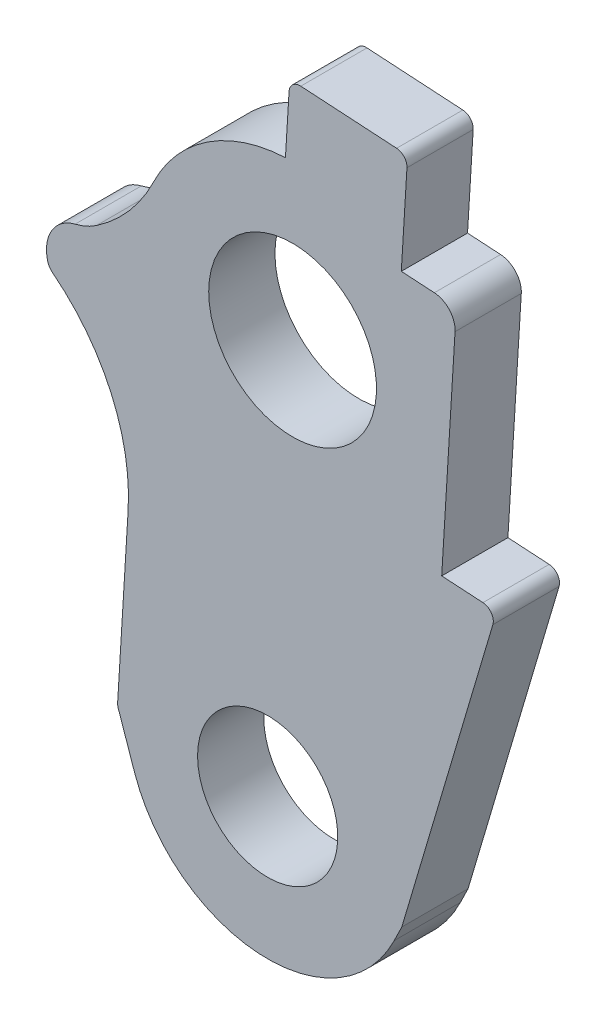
ISO-10303-21;
HEADER;
FILE_DESCRIPTION(('STEP AP214'),'2;1');
FILE_NAME('part.step','',(''),(''),'','','');
FILE_SCHEMA(('AUTOMOTIVE_DESIGN { 1 0 10303 214 1 1 1 1 }'));
ENDSEC;
DATA;
#1=APPLICATION_CONTEXT('core data for automotive mechanical design processes');
#2=APPLICATION_PROTOCOL_DEFINITION('international standard','automotive_design',2000,#1);
#3=PRODUCT_CONTEXT('',#1,'mechanical');
#4=PRODUCT('Part','Part','',(#3));
#5=PRODUCT_RELATED_PRODUCT_CATEGORY('part','',(#4));
#6=PRODUCT_DEFINITION_FORMATION('','',#4);
#7=PRODUCT_DEFINITION_CONTEXT('part definition',#1,'design');
#8=PRODUCT_DEFINITION('design','',#6,#7);
#9=PRODUCT_DEFINITION_SHAPE('','',#8);
#10=(LENGTH_UNIT() NAMED_UNIT(*) SI_UNIT(.MILLI.,.METRE.));
#11=(NAMED_UNIT(*) PLANE_ANGLE_UNIT() SI_UNIT($,.RADIAN.));
#12=(NAMED_UNIT(*) SI_UNIT($,.STERADIAN.) SOLID_ANGLE_UNIT());
#13=UNCERTAINTY_MEASURE_WITH_UNIT(LENGTH_MEASURE(1.E-05),#10,'distance_accuracy_value','');
#14=(GEOMETRIC_REPRESENTATION_CONTEXT(3) GLOBAL_UNCERTAINTY_ASSIGNED_CONTEXT((#13)) GLOBAL_UNIT_ASSIGNED_CONTEXT((#10,
#11,#12)) REPRESENTATION_CONTEXT('',''));
#15=CARTESIAN_POINT('',(0.,0.,0.));
#16=DIRECTION('',(0.,0.,1.));
#17=DIRECTION('',(1.,0.,0.));
#18=AXIS2_PLACEMENT_3D('',#15,#16,#17);
#19=CARTESIAN_POINT('',(12.7,0.,-3.8));
#20=DIRECTION('',(0.,0.,-1.));
#21=DIRECTION('',(-0.998134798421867,0.0610485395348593,0.));
#22=AXIS2_PLACEMENT_3D('',#19,#20,#21);
#23=CYLINDRICAL_SURFACE('',#22,7.);
#24=CARTESIAN_POINT('',(12.7,0.,-6.8));
#25=DIRECTION('',(0.,0.,-1.));
#26=DIRECTION('',(0.998134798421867,-0.0610485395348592,0.));
#27=AXIS2_PLACEMENT_3D('',#24,#25,#26);
#28=CIRCLE('',#27,7.);
#29=CARTESIAN_POINT('',(6.39684887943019,3.04471442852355,-6.8));
#30=VERTEX_POINT('',#29);
#31=CARTESIAN_POINT('',(12.3762787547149,6.9925106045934,-6.8));
#32=VERTEX_POINT('',#31);
#33=EDGE_CURVE('E248',#30,#32,#28,.T.);
#34=ORIENTED_EDGE('',*,*,#33,.F.);
#35=DIRECTION('',(0.,0.,1.));
#36=VECTOR('',#35,1.);
#37=CARTESIAN_POINT('',(6.39684887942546,3.04471442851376,-6.8));
#38=LINE('',#37,#36);
#39=CARTESIAN_POINT('',(6.39684887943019,3.04471442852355,-3.8));
#40=VERTEX_POINT('',#39);
#41=EDGE_CURVE('E170',#30,#40,#38,.T.);
#42=ORIENTED_EDGE('',*,*,#41,.T.);
#43=CARTESIAN_POINT('',(12.7,0.,-3.8));
#44=DIRECTION('',(0.,0.,-1.));
#45=DIRECTION('',(0.998134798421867,-0.0610485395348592,0.));
#46=AXIS2_PLACEMENT_3D('',#43,#44,#45);
#47=CIRCLE('',#46,7.);
#48=CARTESIAN_POINT('',(12.3762787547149,6.9925106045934,-3.8));
#49=VERTEX_POINT('',#48);
#50=EDGE_CURVE('E165',#40,#49,#47,.T.);
#51=ORIENTED_EDGE('',*,*,#50,.T.);
#52=DIRECTION('',(0.,0.,-1.));
#53=VECTOR('',#52,1.);
#54=CARTESIAN_POINT('',(12.3762787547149,6.9925106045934,-3.8));
#55=LINE('',#54,#53);
#56=EDGE_CURVE('E167',#49,#32,#55,.T.);
#57=ORIENTED_EDGE('',*,*,#56,.T.);
#58=EDGE_LOOP('',(#34,#42,#51,#57));
#59=FACE_BOUND('',#58,.T.);
#60=ADVANCED_FACE('F16',(#59),#23,.T.);
#61=CARTESIAN_POINT('',(12.3762787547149,6.9925106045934,-3.8));
#62=DIRECTION('',(-0.998134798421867,0.0610485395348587,0.));
#63=DIRECTION('',(-0.0610485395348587,-0.998134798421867,0.));
#64=AXIS2_PLACEMENT_3D('',#61,#62,#63);
#65=PLANE('',#64);
#66=DIRECTION('',(0.0610485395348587,0.998134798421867,0.));
#67=VECTOR('',#66,1.);
#68=CARTESIAN_POINT('',(12.3762787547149,6.9925106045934,-3.8));
#69=LINE('',#68,#67);
#70=CARTESIAN_POINT('',(12.540517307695,9.67778720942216,-3.8));
#71=VERTEX_POINT('',#70);
#72=EDGE_CURVE('E175',#49,#71,#69,.T.);
#73=ORIENTED_EDGE('',*,*,#72,.T.);
#74=DIRECTION('',(0.,0.,-1.));
#75=VECTOR('',#74,1.);
#76=CARTESIAN_POINT('',(12.540517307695,9.67778720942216,-3.8));
#77=LINE('',#76,#75);
#78=CARTESIAN_POINT('',(12.540517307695,9.67778720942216,-6.8));
#79=VERTEX_POINT('',#78);
#80=EDGE_CURVE('E347',#71,#79,#77,.T.);
#81=ORIENTED_EDGE('',*,*,#80,.T.);
#82=DIRECTION('',(0.0610485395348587,0.998134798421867,0.));
#83=VECTOR('',#82,1.);
#84=CARTESIAN_POINT('',(12.3762787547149,6.9925106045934,-6.8));
#85=LINE('',#84,#83);
#86=EDGE_CURVE('E184',#32,#79,#85,.T.);
#87=ORIENTED_EDGE('',*,*,#86,.F.);
#88=ORIENTED_EDGE('',*,*,#56,.F.);
#89=EDGE_LOOP('',(#73,#81,#87,#88));
#90=FACE_BOUND('',#89,.T.);
#91=ADVANCED_FACE('F180',(#90),#65,.T.);
#92=CARTESIAN_POINT('',(12.5710415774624,10.1768546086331,-3.8));
#93=DIRECTION('',(0.0610485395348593,0.998134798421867,0.));
#94=DIRECTION('',(0.,0.,1.));
#95=AXIS2_PLACEMENT_3D('',#92,#93,#94);
#96=PLANE('',#95);
#97=DIRECTION('',(0.998134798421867,-0.0610485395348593,0.));
#98=VECTOR('',#97,1.);
#99=CARTESIAN_POINT('',(12.5710415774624,10.1768546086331,-6.8));
#100=LINE('',#99,#98);
#101=CARTESIAN_POINT('',(13.0701089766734,10.1463303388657,-6.8));
#102=VERTEX_POINT('',#101);
#103=CARTESIAN_POINT('',(17.4119953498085,9.88076919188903,-6.8));
#104=VERTEX_POINT('',#103);
#105=EDGE_CURVE('E253',#102,#104,#100,.T.);
#106=ORIENTED_EDGE('',*,*,#105,.F.);
#107=DIRECTION('',(0.,0.,-1.));
#108=VECTOR('',#107,1.);
#109=CARTESIAN_POINT('',(13.0701089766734,10.1463303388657,-3.8));
#110=LINE('',#109,#108);
#111=CARTESIAN_POINT('',(13.0701089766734,10.1463303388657,-3.8));
#112=VERTEX_POINT('',#111);
#113=EDGE_CURVE('E354',#102,#112,#110,.F.);
#114=ORIENTED_EDGE('',*,*,#113,.T.);
#115=DIRECTION('',(0.998134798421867,-0.0610485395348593,0.));
#116=VECTOR('',#115,1.);
#117=CARTESIAN_POINT('',(12.5710415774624,10.1768546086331,-3.8));
#118=LINE('',#117,#116);
#119=CARTESIAN_POINT('',(17.4119953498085,9.88076919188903,-3.8));
#120=VERTEX_POINT('',#119);
#121=EDGE_CURVE('E195',#112,#120,#118,.T.);
#122=ORIENTED_EDGE('',*,*,#121,.T.);
#123=DIRECTION('',(0.,0.,-1.));
#124=VECTOR('',#123,1.);
#125=CARTESIAN_POINT('',(17.4119953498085,9.88076919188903,-3.8));
#126=LINE('',#125,#124);
#127=EDGE_CURVE('E350',#120,#104,#126,.T.);
#128=ORIENTED_EDGE('',*,*,#127,.T.);
#129=EDGE_LOOP('',(#106,#114,#122,#128));
#130=FACE_BOUND('',#129,.T.);
#131=ADVANCED_FACE('F651',(#130),#96,.T.);
#132=CARTESIAN_POINT('',(17.9110627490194,9.8502449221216,-3.8));
#133=DIRECTION('',(0.998134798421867,-0.0610485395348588,0.));
#134=DIRECTION('',(0.0610485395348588,0.998134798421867,0.));
#135=AXIS2_PLACEMENT_3D('',#132,#133,#134);
#136=PLANE('',#135);
#137=DIRECTION('',(-0.0610485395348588,-0.998134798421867,0.));
#138=VECTOR('',#137,1.);
#139=CARTESIAN_POINT('',(17.9110627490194,9.8502449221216,-6.8));
#140=LINE('',#139,#138);
#141=CARTESIAN_POINT('',(17.880538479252,9.35117752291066,-6.8));
#142=VERTEX_POINT('',#141);
#143=CARTESIAN_POINT('',(17.6241346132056,5.15901136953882,-6.8));
#144=VERTEX_POINT('',#143);
#145=EDGE_CURVE('E257',#142,#144,#140,.T.);
#146=ORIENTED_EDGE('',*,*,#145,.F.);
#147=DIRECTION('',(0.,0.,-1.));
#148=VECTOR('',#147,1.);
#149=CARTESIAN_POINT('',(17.880538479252,9.35117752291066,-3.8));
#150=LINE('',#149,#148);
#151=CARTESIAN_POINT('',(17.880538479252,9.35117752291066,-3.8));
#152=VERTEX_POINT('',#151);
#153=EDGE_CURVE('E357',#142,#152,#150,.F.);
#154=ORIENTED_EDGE('',*,*,#153,.T.);
#155=DIRECTION('',(-0.0610485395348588,-0.998134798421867,0.));
#156=VECTOR('',#155,1.);
#157=CARTESIAN_POINT('',(17.9110627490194,9.8502449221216,-3.8));
#158=LINE('',#157,#156);
#159=CARTESIAN_POINT('',(17.6241346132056,5.15901136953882,-3.8));
#160=VERTEX_POINT('',#159);
#161=EDGE_CURVE('E203',#152,#160,#158,.T.);
#162=ORIENTED_EDGE('',*,*,#161,.T.);
#163=DIRECTION('',(0.,0.,-1.));
#164=VECTOR('',#163,1.);
#165=CARTESIAN_POINT('',(17.6241346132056,5.15901136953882,-3.8));
#166=LINE('',#165,#164);
#167=EDGE_CURVE('E187',#160,#144,#166,.T.);
#168=ORIENTED_EDGE('',*,*,#167,.T.);
#169=EDGE_LOOP('',(#146,#154,#162,#168));
#170=FACE_BOUND('',#169,.T.);
#171=ADVANCED_FACE('F643',(#170),#136,.T.);
#172=CARTESIAN_POINT('',(17.6241346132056,5.15901136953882,-3.8));
#173=DIRECTION('',(0.0610485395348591,0.998134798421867,0.));
#174=DIRECTION('',(-0.998134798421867,0.0610485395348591,0.));
#175=AXIS2_PLACEMENT_3D('',#172,#173,#174);
#176=PLANE('',#175);
#177=DIRECTION('',(0.998134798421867,-0.0610485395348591,0.));
#178=VECTOR('',#177,1.);
#179=CARTESIAN_POINT('',(17.6241346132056,5.15901136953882,-3.8));
#180=LINE('',#179,#178);
#181=CARTESIAN_POINT('',(19.1213368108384,5.06743856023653,-3.8));
#182=VERTEX_POINT('',#181);
#183=EDGE_CURVE('E209',#160,#182,#180,.T.);
#184=ORIENTED_EDGE('',*,*,#183,.T.);
#185=DIRECTION('',(0.,0.,-1.));
#186=VECTOR('',#185,1.);
#187=CARTESIAN_POINT('',(19.1213368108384,5.06743856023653,-3.8));
#188=LINE('',#187,#186);
#189=CARTESIAN_POINT('',(19.1213368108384,5.06743856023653,-6.8));
#190=VERTEX_POINT('',#189);
#191=EDGE_CURVE('E360',#182,#190,#188,.T.);
#192=ORIENTED_EDGE('',*,*,#191,.T.);
#193=DIRECTION('',(0.998134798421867,-0.0610485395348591,0.));
#194=VECTOR('',#193,1.);
#195=CARTESIAN_POINT('',(17.6241346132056,5.15901136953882,-6.8));
#196=LINE('',#195,#194);
#197=EDGE_CURVE('E260',#144,#190,#196,.T.);
#198=ORIENTED_EDGE('',*,*,#197,.F.);
#199=ORIENTED_EDGE('',*,*,#167,.F.);
#200=EDGE_LOOP('',(#184,#192,#198,#199));
#201=FACE_BOUND('',#200,.T.);
#202=ADVANCED_FACE('F635',(#201),#176,.T.);
#203=CARTESIAN_POINT('',(19.9450019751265,2.15383671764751,-3.8));
#204=DIRECTION('',(0.998134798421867,-0.0610485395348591,0.));
#205=DIRECTION('',(0.0610485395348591,0.998134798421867,0.));
#206=AXIS2_PLACEMENT_3D('',#203,#204,#205);
#207=PLANE('',#206);
#208=DIRECTION('',(-0.0610485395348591,-0.998134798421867,0.));
#209=VECTOR('',#208,1.);
#210=CARTESIAN_POINT('',(19.9450019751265,2.15383671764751,-6.8));
#211=LINE('',#210,#209);
#212=CARTESIAN_POINT('',(20.0584230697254,4.00825522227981,-6.8));
#213=VERTEX_POINT('',#212);
#214=CARTESIAN_POINT('',(19.4540425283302,-5.87327928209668,-6.8));
#215=VERTEX_POINT('',#214);
#216=EDGE_CURVE('E264',#213,#215,#211,.T.);
#217=ORIENTED_EDGE('',*,*,#216,.F.);
#218=DIRECTION('',(0.,0.,-1.));
#219=VECTOR('',#218,1.);
#220=CARTESIAN_POINT('',(20.0584230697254,4.0082552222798,-3.8));
#221=LINE('',#220,#219);
#222=CARTESIAN_POINT('',(20.0584230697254,4.00825522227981,-3.8));
#223=VERTEX_POINT('',#222);
#224=EDGE_CURVE('E367',#213,#223,#221,.F.);
#225=ORIENTED_EDGE('',*,*,#224,.T.);
#226=DIRECTION('',(-0.0610485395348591,-0.998134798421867,0.));
#227=VECTOR('',#226,1.);
#228=CARTESIAN_POINT('',(19.9450019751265,2.15383671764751,-3.8));
#229=LINE('',#228,#227);
#230=CARTESIAN_POINT('',(19.4540425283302,-5.87327928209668,-3.8));
#231=VERTEX_POINT('',#230);
#232=EDGE_CURVE('E213',#223,#231,#229,.T.);
#233=ORIENTED_EDGE('',*,*,#232,.T.);
#234=DIRECTION('',(0.,0.,-1.));
#235=VECTOR('',#234,1.);
#236=CARTESIAN_POINT('',(19.4540425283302,-5.87327928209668,-3.8));
#237=LINE('',#236,#235);
#238=EDGE_CURVE('E304',#231,#215,#237,.T.);
#239=ORIENTED_EDGE('',*,*,#238,.T.);
#240=EDGE_LOOP('',(#217,#225,#233,#239));
#241=FACE_BOUND('',#240,.T.);
#242=ADVANCED_FACE('F625',(#241),#207,.T.);
#243=CARTESIAN_POINT('',(19.4540425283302,-5.87327928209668,-3.8));
#244=DIRECTION('',(0.0610485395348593,0.998134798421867,0.));
#245=DIRECTION('',(0.,0.,1.));
#246=AXIS2_PLACEMENT_3D('',#243,#244,#245);
#247=PLANE('',#246);
#248=DIRECTION('',(0.998134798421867,-0.0610485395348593,0.));
#249=VECTOR('',#248,1.);
#250=CARTESIAN_POINT('',(19.4540425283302,-5.87327928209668,-3.8));
#251=LINE('',#250,#249);
#252=CARTESIAN_POINT('',(21.3219658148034,-5.98752636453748,-3.8));
#253=VERTEX_POINT('',#252);
#254=EDGE_CURVE('E216',#231,#253,#251,.T.);
#255=ORIENTED_EDGE('',*,*,#254,.T.);
#256=DIRECTION('',(0.,0.,-1.));
#257=VECTOR('',#256,1.);
#258=CARTESIAN_POINT('',(21.3219658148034,-5.98752636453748,-3.8));
#259=LINE('',#258,#257);
#260=CARTESIAN_POINT('',(21.3219658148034,-5.98752636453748,-6.8));
#261=VERTEX_POINT('',#260);
#262=EDGE_CURVE('E340',#253,#261,#259,.T.);
#263=ORIENTED_EDGE('',*,*,#262,.T.);
#264=DIRECTION('',(0.998134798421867,-0.0610485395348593,0.));
#265=VECTOR('',#264,1.);
#266=CARTESIAN_POINT('',(19.4540425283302,-5.87327928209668,-6.8));
#267=LINE('',#266,#265);
#268=EDGE_CURVE('E267',#215,#261,#267,.T.);
#269=ORIENTED_EDGE('',*,*,#268,.F.);
#270=ORIENTED_EDGE('',*,*,#238,.F.);
#271=EDGE_LOOP('',(#255,#263,#269,#270));
#272=FACE_BOUND('',#271,.T.);
#273=ADVANCED_FACE('F616',(#272),#247,.T.);
#274=CARTESIAN_POINT('',(21.949379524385,-6.02590063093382,-3.8));
#275=DIRECTION('',(0.958819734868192,-0.284015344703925,0.));
#276=DIRECTION('',(0.284015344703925,0.958819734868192,0.));
#277=AXIS2_PLACEMENT_3D('',#274,#275,#276);
#278=PLANE('',#277);
#279=DIRECTION('',(-0.284015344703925,-0.958819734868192,0.));
#280=VECTOR('',#279,1.);
#281=CARTESIAN_POINT('',(21.949379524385,-6.02590063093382,-6.8));
#282=LINE('',#281,#280);
#283=CARTESIAN_POINT('',(21.7708514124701,-6.62860143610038,-6.8));
#284=VERTEX_POINT('',#283);
#285=CARTESIAN_POINT('',(17.6477446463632,-20.5479766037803,-6.8));
#286=VERTEX_POINT('',#285);
#287=EDGE_CURVE('E271',#284,#286,#282,.T.);
#288=ORIENTED_EDGE('',*,*,#287,.F.);
#289=DIRECTION('',(0.,0.,-1.));
#290=VECTOR('',#289,1.);
#291=CARTESIAN_POINT('',(21.7708514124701,-6.62860143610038,-3.8));
#292=LINE('',#291,#290);
#293=CARTESIAN_POINT('',(21.7708514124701,-6.62860143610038,-3.8));
#294=VERTEX_POINT('',#293);
#295=EDGE_CURVE('E344',#284,#294,#292,.F.);
#296=ORIENTED_EDGE('',*,*,#295,.T.);
#297=DIRECTION('',(-0.284015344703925,-0.958819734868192,0.));
#298=VECTOR('',#297,1.);
#299=CARTESIAN_POINT('',(21.949379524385,-6.02590063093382,-3.8));
#300=LINE('',#299,#298);
#301=CARTESIAN_POINT('',(17.6477446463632,-20.5479766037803,-3.8));
#302=VERTEX_POINT('',#301);
#303=EDGE_CURVE('E220',#294,#302,#300,.T.);
#304=ORIENTED_EDGE('',*,*,#303,.T.);
#305=DIRECTION('',(0.,0.,-1.));
#306=VECTOR('',#305,1.);
#307=CARTESIAN_POINT('',(17.6477446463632,-20.5479766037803,-3.8));
#308=LINE('',#307,#306);
#309=EDGE_CURVE('E300',#302,#286,#308,.T.);
#310=ORIENTED_EDGE('',*,*,#309,.T.);
#311=EDGE_LOOP('',(#288,#296,#304,#310));
#312=FACE_BOUND('',#311,.T.);
#313=ADVANCED_FACE('F607',(#312),#278,.T.);
#314=CARTESIAN_POINT('',(17.6477446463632,-20.5479766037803,-3.8));
#315=DIRECTION('',(0.898794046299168,-0.438371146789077,0.));
#316=DIRECTION('',(0.438371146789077,0.898794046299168,0.));
#317=AXIS2_PLACEMENT_3D('',#314,#315,#316);
#318=PLANE('',#317);
#319=DIRECTION('',(-0.438371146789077,-0.898794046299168,0.));
#320=VECTOR('',#319,1.);
#321=CARTESIAN_POINT('',(17.6477446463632,-20.5479766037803,-6.8));
#322=LINE('',#321,#320);
#323=CARTESIAN_POINT('',(17.3004140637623,-21.2601098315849,-6.8));
#324=VERTEX_POINT('',#323);
#325=EDGE_CURVE('E274',#286,#324,#322,.T.);
#326=ORIENTED_EDGE('',*,*,#325,.F.);
#327=ORIENTED_EDGE('',*,*,#309,.F.);
#328=DIRECTION('',(-0.438371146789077,-0.898794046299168,0.));
#329=VECTOR('',#328,1.);
#330=CARTESIAN_POINT('',(17.6477446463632,-20.5479766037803,-3.8));
#331=LINE('',#330,#329);
#332=CARTESIAN_POINT('',(17.3004140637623,-21.2601098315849,-3.8));
#333=VERTEX_POINT('',#332);
#334=EDGE_CURVE('E223',#302,#333,#331,.T.);
#335=ORIENTED_EDGE('',*,*,#334,.T.);
#336=DIRECTION('',(0.,0.,-1.));
#337=VECTOR('',#336,1.);
#338=CARTESIAN_POINT('',(17.3004140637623,-21.2601098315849,-3.8));
#339=LINE('',#338,#337);
#340=EDGE_CURVE('E297',#333,#324,#339,.T.);
#341=ORIENTED_EDGE('',*,*,#340,.T.);
#342=EDGE_LOOP('',(#326,#327,#335,#341));
#343=FACE_BOUND('',#342,.T.);
#344=ADVANCED_FACE('F598',(#343),#318,.T.);
#345=CARTESIAN_POINT('',(11.5706020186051,-18.4654937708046,-3.8));
#346=DIRECTION('',(0.,0.,-1.));
#347=DIRECTION('',(-0.998134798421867,0.0610485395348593,0.));
#348=AXIS2_PLACEMENT_3D('',#345,#346,#347);
#349=CYLINDRICAL_SURFACE('',#348,6.375);
#350=CARTESIAN_POINT('',(11.5706020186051,-18.4654937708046,-6.8));
#351=DIRECTION('',(0.,0.,-1.));
#352=DIRECTION('',(0.998134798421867,-0.0610485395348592,0.));
#353=AXIS2_PLACEMENT_3D('',#350,#351,#352);
#354=CIRCLE('',#353,6.375);
#355=CARTESIAN_POINT('',(5.54292109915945,-20.5409907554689,-6.8));
#356=VERTEX_POINT('',#355);
#357=EDGE_CURVE('E278',#324,#356,#354,.T.);
#358=ORIENTED_EDGE('',*,*,#357,.F.);
#359=ORIENTED_EDGE('',*,*,#340,.F.);
#360=CARTESIAN_POINT('',(11.5706020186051,-18.4654937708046,-3.8));
#361=DIRECTION('',(0.,0.,-1.));
#362=DIRECTION('',(0.998134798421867,-0.0610485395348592,0.));
#363=AXIS2_PLACEMENT_3D('',#360,#361,#362);
#364=CIRCLE('',#363,6.375);
#365=CARTESIAN_POINT('',(5.54292109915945,-20.5409907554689,-3.8));
#366=VERTEX_POINT('',#365);
#367=EDGE_CURVE('E227',#333,#366,#364,.T.);
#368=ORIENTED_EDGE('',*,*,#367,.T.);
#369=DIRECTION('',(0.,0.,-1.));
#370=VECTOR('',#369,1.);
#371=CARTESIAN_POINT('',(5.54292109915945,-20.5409907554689,-3.8));
#372=LINE('',#371,#370);
#373=EDGE_CURVE('E247',#366,#356,#372,.T.);
#374=ORIENTED_EDGE('',*,*,#373,.T.);
#375=EDGE_LOOP('',(#358,#359,#368,#374));
#376=FACE_BOUND('',#375,.T.);
#377=ADVANCED_FACE('F589',(#376),#349,.T.);
#378=CARTESIAN_POINT('',(5.54292109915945,-20.5409907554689,-3.8));
#379=DIRECTION('',(-0.945518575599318,-0.325568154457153,0.));
#380=DIRECTION('',(0.325568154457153,-0.945518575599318,0.));
#381=AXIS2_PLACEMENT_3D('',#378,#379,#380);
#382=PLANE('',#381);
#383=DIRECTION('',(-0.325568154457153,0.945518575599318,0.));
#384=VECTOR('',#383,1.);
#385=CARTESIAN_POINT('',(5.54292109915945,-20.5409907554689,-3.8));
#386=LINE('',#385,#384);
#387=CARTESIAN_POINT('',(4.80088984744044,-18.3859755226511,-3.8));
#388=VERTEX_POINT('',#387);
#389=EDGE_CURVE('E231',#366,#388,#386,.T.);
#390=ORIENTED_EDGE('',*,*,#389,.T.);
#391=DIRECTION('',(0.,0.,-1.));
#392=VECTOR('',#391,1.);
#393=CARTESIAN_POINT('',(4.80088984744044,-18.3859755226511,-3.8));
#394=LINE('',#393,#392);
#395=CARTESIAN_POINT('',(4.80088984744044,-18.3859755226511,-6.8));
#396=VERTEX_POINT('',#395);
#397=EDGE_CURVE('E186',#388,#396,#394,.T.);
#398=ORIENTED_EDGE('',*,*,#397,.T.);
#399=DIRECTION('',(-0.325568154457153,0.945518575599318,0.));
#400=VECTOR('',#399,1.);
#401=CARTESIAN_POINT('',(5.54292109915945,-20.5409907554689,-6.8));
#402=LINE('',#401,#400);
#403=EDGE_CURVE('E281',#356,#396,#402,.T.);
#404=ORIENTED_EDGE('',*,*,#403,.F.);
#405=ORIENTED_EDGE('',*,*,#373,.F.);
#406=EDGE_LOOP('',(#390,#398,#404,#405));
#407=FACE_BOUND('',#406,.T.);
#408=ADVANCED_FACE('F580',(#407),#382,.T.);
#409=CARTESIAN_POINT('',(4.76851008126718,-18.2919378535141,-3.8));
#410=DIRECTION('',(-0.998134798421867,0.0610485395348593,0.));
#411=DIRECTION('',(0.,0.,1.));
#412=AXIS2_PLACEMENT_3D('',#409,#410,#411);
#413=PLANE('',#412);
#414=DIRECTION('',(0.0610485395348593,0.998134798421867,0.));
#415=VECTOR('',#414,1.);
#416=CARTESIAN_POINT('',(4.76851008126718,-18.2919378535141,-3.8));
#417=LINE('',#416,#415);
#418=CARTESIAN_POINT('',(4.77458173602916,-18.192667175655,-3.8));
#419=VERTEX_POINT('',#418);
#420=CARTESIAN_POINT('',(5.25007554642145,-10.4184120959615,-3.8));
#421=VERTEX_POINT('',#420);
#422=EDGE_CURVE('E235',#419,#421,#417,.T.);
#423=ORIENTED_EDGE('',*,*,#422,.T.);
#424=DIRECTION('',(0.,0.,-1.));
#425=VECTOR('',#424,1.);
#426=CARTESIAN_POINT('',(5.25007554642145,-10.4184120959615,-6.8));
#427=LINE('',#426,#425);
#428=CARTESIAN_POINT('',(5.25007554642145,-10.4184120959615,-6.8));
#429=VERTEX_POINT('',#428);
#430=EDGE_CURVE('E373',#421,#429,#427,.T.);
#431=ORIENTED_EDGE('',*,*,#430,.T.);
#432=DIRECTION('',(0.0610485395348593,0.998134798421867,0.));
#433=VECTOR('',#432,1.);
#434=CARTESIAN_POINT('',(4.76851008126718,-18.2919378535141,-6.8));
#435=LINE('',#434,#433);
#436=CARTESIAN_POINT('',(4.77458173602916,-18.192667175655,-6.8));
#437=VERTEX_POINT('',#436);
#438=EDGE_CURVE('E285',#437,#429,#435,.T.);
#439=ORIENTED_EDGE('',*,*,#438,.F.);
#440=DIRECTION('',(0.,0.,-1.));
#441=VECTOR('',#440,1.);
#442=CARTESIAN_POINT('',(4.77458173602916,-18.192667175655,-3.8));
#443=LINE('',#442,#441);
#444=EDGE_CURVE('E326',#437,#419,#443,.F.);
#445=ORIENTED_EDGE('',*,*,#444,.T.);
#446=EDGE_LOOP('',(#423,#431,#439,#445));
#447=FACE_BOUND('',#446,.T.);
#448=ADVANCED_FACE('F570',(#447),#413,.T.);
#449=CARTESIAN_POINT('',(12.7,0.,-3.8));
#450=DIRECTION('',(0.,0.,-1.));
#451=DIRECTION('',(-0.998134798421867,0.0610485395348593,0.));
#452=AXIS2_PLACEMENT_3D('',#449,#450,#451);
#453=CYLINDRICAL_SURFACE('',#452,3.8);
#454=CARTESIAN_POINT('',(12.7,0.,-3.8));
#455=DIRECTION('',(0.,0.,1.));
#456=DIRECTION('',(0.998134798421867,-0.0610485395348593,0.));
#457=AXIS2_PLACEMENT_3D('',#454,#455,#456);
#458=CIRCLE('',#457,3.8);
#459=CARTESIAN_POINT('',(16.4929122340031,-0.231984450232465,-3.8));
#460=VERTEX_POINT('',#459);
#461=EDGE_CURVE('E239',#460,#460,#458,.F.);
#462=ORIENTED_EDGE('',*,*,#461,.F.);
#463=EDGE_LOOP('',(#462));
#464=FACE_BOUND('',#463,.T.);
#465=CARTESIAN_POINT('',(12.7,0.,-6.8));
#466=DIRECTION('',(0.,0.,1.));
#467=DIRECTION('',(0.998134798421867,-0.0610485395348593,0.));
#468=AXIS2_PLACEMENT_3D('',#465,#466,#467);
#469=CIRCLE('',#468,3.8);
#470=CARTESIAN_POINT('',(16.4929122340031,-0.231984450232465,-6.8));
#471=VERTEX_POINT('',#470);
#472=EDGE_CURVE('E289',#471,#471,#469,.F.);
#473=ORIENTED_EDGE('',*,*,#472,.T.);
#474=EDGE_LOOP('',(#473));
#475=FACE_BOUND('',#474,.T.);
#476=ADVANCED_FACE('F561',(#464,#475),#453,.F.);
#477=CARTESIAN_POINT('',(11.5706020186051,-18.4654937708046,-3.8));
#478=DIRECTION('',(0.,0.,-1.));
#479=DIRECTION('',(-0.998134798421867,0.0610485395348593,0.));
#480=AXIS2_PLACEMENT_3D('',#477,#478,#479);
#481=CYLINDRICAL_SURFACE('',#480,3.175);
#482=CARTESIAN_POINT('',(11.5706020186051,-18.4654937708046,-3.8));
#483=DIRECTION('',(0.,0.,-1.));
#484=DIRECTION('',(0.998134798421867,-0.0610485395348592,0.));
#485=AXIS2_PLACEMENT_3D('',#482,#483,#484);
#486=CIRCLE('',#485,3.175);
#487=CARTESIAN_POINT('',(14.7396800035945,-18.6593228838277,-3.8));
#488=VERTEX_POINT('',#487);
#489=EDGE_CURVE('E243',#488,#488,#486,.T.);
#490=ORIENTED_EDGE('',*,*,#489,.F.);
#491=EDGE_LOOP('',(#490));
#492=FACE_BOUND('',#491,.T.);
#493=CARTESIAN_POINT('',(11.5706020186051,-18.4654937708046,-6.8));
#494=DIRECTION('',(0.,0.,-1.));
#495=DIRECTION('',(0.998134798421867,-0.0610485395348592,0.));
#496=AXIS2_PLACEMENT_3D('',#493,#494,#495);
#497=CIRCLE('',#496,3.175);
#498=CARTESIAN_POINT('',(14.7396800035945,-18.6593228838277,-6.8));
#499=VERTEX_POINT('',#498);
#500=EDGE_CURVE('E176',#499,#499,#497,.T.);
#501=ORIENTED_EDGE('',*,*,#500,.T.);
#502=EDGE_LOOP('',(#501));
#503=FACE_BOUND('',#502,.T.);
#504=ADVANCED_FACE('F414',(#492,#503),#481,.F.);
#505=CARTESIAN_POINT('',(12.7,0.,-3.8));
#506=DIRECTION('',(0.,0.,-1.));
#507=DIRECTION('',(-0.998134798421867,0.0610485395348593,0.));
#508=AXIS2_PLACEMENT_3D('',#505,#506,#507);
#509=PLANE('',#508);
#510=CARTESIAN_POINT('',(3.24562074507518,-2.0243875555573,-3.8));
#511=DIRECTION('',(0.,0.,1.));
#512=DIRECTION('',(-0.998134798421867,0.0610485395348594,0.));
#513=AXIS2_PLACEMENT_3D('',#510,#511,#512);
#514=CIRCLE('',#513,1.69367648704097);
#515=CARTESIAN_POINT('',(2.84816426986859,-0.378007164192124,-3.8));
#516=VERTEX_POINT('',#515);
#517=CARTESIAN_POINT('',(1.61286972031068,-2.47456988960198,-3.8));
#518=VERTEX_POINT('',#517);
#519=EDGE_CURVE('E733',#516,#518,#514,.T.);
#520=ORIENTED_EDGE('',*,*,#519,.T.);
#521=CARTESIAN_POINT('',(2.19128633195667,-2.3150887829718,-3.8));
#522=DIRECTION('',(0.,0.,-1.));
#523=DIRECTION('',(-1.,0.,0.));
#524=AXIS2_PLACEMENT_3D('',#521,#522,#523);
#525=CIRCLE('',#524,0.6);
#526=CARTESIAN_POINT('',(1.82100983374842,-2.7872066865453,-3.8));
#527=VERTEX_POINT('',#526);
#528=EDGE_CURVE('E39',#518,#527,#525,.F.);
#529=ORIENTED_EDGE('',*,*,#528,.T.);
#530=CARTESIAN_POINT('',(-3.73313763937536,-9.86897524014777,-3.8));
#531=DIRECTION('',(0.,0.,-1.));
#532=DIRECTION('',(-1.,0.,0.));
#533=AXIS2_PLACEMENT_3D('',#530,#531,#532);
#534=CIRCLE('',#533,9.);
#535=EDGE_CURVE('E376',#527,#421,#534,.T.);
#536=ORIENTED_EDGE('',*,*,#535,.T.);
#537=ORIENTED_EDGE('',*,*,#422,.F.);
#538=CARTESIAN_POINT('',(5.27364913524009,-18.2231914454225,-3.8));
#539=DIRECTION('',(0.,0.,-1.));
#540=DIRECTION('',(-0.998134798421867,0.0610485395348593,0.));
#541=AXIS2_PLACEMENT_3D('',#538,#539,#540);
#542=CIRCLE('',#541,0.5);
#543=EDGE_CURVE('E337',#419,#388,#542,.F.);
#544=ORIENTED_EDGE('',*,*,#543,.T.);
#545=ORIENTED_EDGE('',*,*,#389,.F.);
#546=ORIENTED_EDGE('',*,*,#367,.F.);
#547=ORIENTED_EDGE('',*,*,#334,.F.);
#548=ORIENTED_EDGE('',*,*,#303,.F.);
#549=CARTESIAN_POINT('',(21.291441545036,-6.48659376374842,-3.8));
#550=DIRECTION('',(0.,0.,-1.));
#551=DIRECTION('',(-0.998134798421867,0.0610485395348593,0.));
#552=AXIS2_PLACEMENT_3D('',#549,#550,#551);
#553=CIRCLE('',#552,0.5);
#554=EDGE_CURVE('E334',#294,#253,#553,.F.);
#555=ORIENTED_EDGE('',*,*,#554,.T.);
#556=ORIENTED_EDGE('',*,*,#254,.F.);
#557=ORIENTED_EDGE('',*,*,#232,.F.);
#558=CARTESIAN_POINT('',(19.0602882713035,4.06930376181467,-3.8));
#559=DIRECTION('',(0.,0.,-1.));
#560=DIRECTION('',(-1.,0.,0.));
#561=AXIS2_PLACEMENT_3D('',#558,#559,#560);
#562=CIRCLE('',#561,1.);
#563=EDGE_CURVE('E370',#223,#182,#562,.F.);
#564=ORIENTED_EDGE('',*,*,#563,.T.);
#565=ORIENTED_EDGE('',*,*,#183,.F.);
#566=ORIENTED_EDGE('',*,*,#161,.F.);
#567=CARTESIAN_POINT('',(17.381471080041,9.38170179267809,-3.8));
#568=DIRECTION('',(0.,0.,-1.));
#569=DIRECTION('',(-0.998134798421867,0.0610485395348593,0.));
#570=AXIS2_PLACEMENT_3D('',#567,#568,#569);
#571=CIRCLE('',#570,0.5);
#572=EDGE_CURVE('E329',#152,#120,#571,.F.);
#573=ORIENTED_EDGE('',*,*,#572,.T.);
#574=ORIENTED_EDGE('',*,*,#121,.F.);
#575=CARTESIAN_POINT('',(13.0395847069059,9.64726293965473,-3.8));
#576=DIRECTION('',(0.,0.,-1.));
#577=DIRECTION('',(-0.998134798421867,0.0610485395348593,0.));
#578=AXIS2_PLACEMENT_3D('',#575,#576,#577);
#579=CIRCLE('',#578,0.5);
#580=EDGE_CURVE('E193',#112,#71,#579,.F.);
#581=ORIENTED_EDGE('',*,*,#580,.T.);
#582=ORIENTED_EDGE('',*,*,#72,.F.);
#583=ORIENTED_EDGE('',*,*,#50,.F.);
#584=CARTESIAN_POINT('',(-0.486755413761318,6.36981466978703,-3.8));
#585=DIRECTION('',(0.,0.,-1.));
#586=DIRECTION('',(-0.998134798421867,0.0610485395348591,0.));
#587=AXIS2_PLACEMENT_3D('',#584,#585,#586);
#588=CIRCLE('',#587,7.64462554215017);
#589=CARTESIAN_POINT('',(3.8164629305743,0.0513804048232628,-3.8));
#590=VERTEX_POINT('',#589);
#591=EDGE_CURVE('E731',#40,#590,#588,.T.);
#592=ORIENTED_EDGE('',*,*,#591,.T.);
#593=CARTESIAN_POINT('',(2.15588530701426,2.48961377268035,-3.8));
#594=DIRECTION('',(0.,0.,-1.));
#595=DIRECTION('',(-1.,0.,0.));
#596=AXIS2_PLACEMENT_3D('',#593,#594,#595);
#597=CIRCLE('',#596,2.95);
#598=EDGE_CURVE('E389',#590,#516,#597,.T.);
#599=ORIENTED_EDGE('',*,*,#598,.T.);
#600=EDGE_LOOP('',(#520,#529,#536,#537,#544,#545,#546,#547,#548,#555,#556,#557,#564,#565,#566,
#573,#574,#581,#582,#583,#592,#599));
#601=FACE_BOUND('',#600,.T.);
#602=ORIENTED_EDGE('',*,*,#461,.T.);
#603=EDGE_LOOP('',(#602));
#604=FACE_BOUND('',#603,.T.);
#605=ORIENTED_EDGE('',*,*,#489,.T.);
#606=EDGE_LOOP('',(#605));
#607=FACE_BOUND('',#606,.T.);
#608=ADVANCED_FACE('F189',(#601,#604,#607),#509,.F.);
#609=CARTESIAN_POINT('',(12.7,0.,-6.8));
#610=DIRECTION('',(0.,0.,-1.));
#611=DIRECTION('',(-0.998134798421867,0.0610485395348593,0.));
#612=AXIS2_PLACEMENT_3D('',#609,#610,#611);
#613=PLANE('',#612);
#614=CARTESIAN_POINT('',(-3.73313763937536,-9.86897524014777,-6.8));
#615=DIRECTION('',(0.,0.,-1.));
#616=DIRECTION('',(-1.,0.,0.));
#617=AXIS2_PLACEMENT_3D('',#614,#615,#616);
#618=CIRCLE('',#617,9.);
#619=CARTESIAN_POINT('',(1.82100983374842,-2.7872066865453,-6.8));
#620=VERTEX_POINT('',#619);
#621=EDGE_CURVE('E379',#429,#620,#618,.F.);
#622=ORIENTED_EDGE('',*,*,#621,.T.);
#623=CARTESIAN_POINT('',(2.19128633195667,-2.3150887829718,-6.8));
#624=DIRECTION('',(0.,0.,-1.));
#625=DIRECTION('',(-1.,0.,0.));
#626=AXIS2_PLACEMENT_3D('',#623,#624,#625);
#627=CIRCLE('',#626,0.6);
#628=CARTESIAN_POINT('',(1.61286972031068,-2.47456988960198,-6.8));
#629=VERTEX_POINT('',#628);
#630=EDGE_CURVE('E11',#620,#629,#627,.T.);
#631=ORIENTED_EDGE('',*,*,#630,.T.);
#632=CARTESIAN_POINT('',(3.24562074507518,-2.0243875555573,-6.8));
#633=DIRECTION('',(0.,0.,1.));
#634=DIRECTION('',(-0.998134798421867,0.0610485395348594,0.));
#635=AXIS2_PLACEMENT_3D('',#632,#633,#634);
#636=CIRCLE('',#635,1.69367648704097);
#637=CARTESIAN_POINT('',(2.84816426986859,-0.378007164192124,-6.8));
#638=VERTEX_POINT('',#637);
#639=EDGE_CURVE('E728',#638,#629,#636,.T.);
#640=ORIENTED_EDGE('',*,*,#639,.F.);
#641=CARTESIAN_POINT('',(2.15588530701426,2.48961377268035,-6.8));
#642=DIRECTION('',(0.,0.,-1.));
#643=DIRECTION('',(-1.,0.,0.));
#644=AXIS2_PLACEMENT_3D('',#641,#642,#643);
#645=CIRCLE('',#644,2.95);
#646=CARTESIAN_POINT('',(3.8164629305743,0.0513804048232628,-6.8));
#647=VERTEX_POINT('',#646);
#648=EDGE_CURVE('E392',#638,#647,#645,.F.);
#649=ORIENTED_EDGE('',*,*,#648,.T.);
#650=CARTESIAN_POINT('',(-0.486755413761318,6.36981466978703,-6.8));
#651=DIRECTION('',(0.,0.,-1.));
#652=DIRECTION('',(-0.998134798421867,0.0610485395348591,0.));
#653=AXIS2_PLACEMENT_3D('',#650,#651,#652);
#654=CIRCLE('',#653,7.64462554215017);
#655=EDGE_CURVE('E725',#30,#647,#654,.T.);
#656=ORIENTED_EDGE('',*,*,#655,.F.);
#657=ORIENTED_EDGE('',*,*,#33,.T.);
#658=ORIENTED_EDGE('',*,*,#86,.T.);
#659=CARTESIAN_POINT('',(13.0395847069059,9.64726293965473,-6.8));
#660=DIRECTION('',(0.,0.,-1.));
#661=DIRECTION('',(-0.998134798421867,0.0610485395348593,0.));
#662=AXIS2_PLACEMENT_3D('',#659,#660,#661);
#663=CIRCLE('',#662,0.5);
#664=EDGE_CURVE('E317',#79,#102,#663,.T.);
#665=ORIENTED_EDGE('',*,*,#664,.T.);
#666=ORIENTED_EDGE('',*,*,#105,.T.);
#667=CARTESIAN_POINT('',(17.381471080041,9.38170179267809,-6.8));
#668=DIRECTION('',(0.,0.,-1.));
#669=DIRECTION('',(-0.998134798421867,0.0610485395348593,0.));
#670=AXIS2_PLACEMENT_3D('',#667,#668,#669);
#671=CIRCLE('',#670,0.5);
#672=EDGE_CURVE('E314',#104,#142,#671,.T.);
#673=ORIENTED_EDGE('',*,*,#672,.T.);
#674=ORIENTED_EDGE('',*,*,#145,.T.);
#675=ORIENTED_EDGE('',*,*,#197,.T.);
#676=CARTESIAN_POINT('',(19.0602882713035,4.06930376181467,-6.8));
#677=DIRECTION('',(0.,0.,-1.));
#678=DIRECTION('',(-1.,0.,0.));
#679=AXIS2_PLACEMENT_3D('',#676,#677,#678);
#680=CIRCLE('',#679,1.);
#681=EDGE_CURVE('E364',#190,#213,#680,.T.);
#682=ORIENTED_EDGE('',*,*,#681,.T.);
#683=ORIENTED_EDGE('',*,*,#216,.T.);
#684=ORIENTED_EDGE('',*,*,#268,.T.);
#685=CARTESIAN_POINT('',(21.291441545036,-6.48659376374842,-6.8));
#686=DIRECTION('',(0.,0.,-1.));
#687=DIRECTION('',(-0.998134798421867,0.0610485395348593,0.));
#688=AXIS2_PLACEMENT_3D('',#685,#686,#687);
#689=CIRCLE('',#688,0.5);
#690=EDGE_CURVE('E320',#261,#284,#689,.T.);
#691=ORIENTED_EDGE('',*,*,#690,.T.);
#692=ORIENTED_EDGE('',*,*,#287,.T.);
#693=ORIENTED_EDGE('',*,*,#325,.T.);
#694=ORIENTED_EDGE('',*,*,#357,.T.);
#695=ORIENTED_EDGE('',*,*,#403,.T.);
#696=CARTESIAN_POINT('',(5.27364913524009,-18.2231914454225,-6.8));
#697=DIRECTION('',(0.,0.,-1.));
#698=DIRECTION('',(-0.998134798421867,0.0610485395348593,0.));
#699=AXIS2_PLACEMENT_3D('',#696,#697,#698);
#700=CIRCLE('',#699,0.5);
#701=EDGE_CURVE('E323',#396,#437,#700,.T.);
#702=ORIENTED_EDGE('',*,*,#701,.T.);
#703=ORIENTED_EDGE('',*,*,#438,.T.);
#704=EDGE_LOOP('',(#622,#631,#640,#649,#656,#657,#658,#665,#666,#673,#674,#675,#682,#683,#684,
#691,#692,#693,#694,#695,#702,#703));
#705=FACE_BOUND('',#704,.T.);
#706=ORIENTED_EDGE('',*,*,#472,.F.);
#707=EDGE_LOOP('',(#706));
#708=FACE_BOUND('',#707,.T.);
#709=ORIENTED_EDGE('',*,*,#500,.F.);
#710=EDGE_LOOP('',(#709));
#711=FACE_BOUND('',#710,.T.);
#712=ADVANCED_FACE('F413',(#705,#708,#711),#613,.T.);
#713=CARTESIAN_POINT('',(5.27364913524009,-18.2231914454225,-3.8));
#714=DIRECTION('',(0.,0.,-1.));
#715=DIRECTION('',(-0.998134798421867,0.0610485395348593,0.));
#716=AXIS2_PLACEMENT_3D('',#713,#714,#715);
#717=CYLINDRICAL_SURFACE('',#716,0.5);
#718=ORIENTED_EDGE('',*,*,#543,.F.);
#719=ORIENTED_EDGE('',*,*,#444,.F.);
#720=ORIENTED_EDGE('',*,*,#701,.F.);
#721=ORIENTED_EDGE('',*,*,#397,.F.);
#722=EDGE_LOOP('',(#718,#719,#720,#721));
#723=FACE_BOUND('',#722,.T.);
#724=ADVANCED_FACE('F424',(#723),#717,.T.);
#725=CARTESIAN_POINT('',(21.291441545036,-6.48659376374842,-3.8));
#726=DIRECTION('',(0.,0.,-1.));
#727=DIRECTION('',(-0.998134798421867,0.0610485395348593,0.));
#728=AXIS2_PLACEMENT_3D('',#725,#726,#727);
#729=CYLINDRICAL_SURFACE('',#728,0.5);
#730=ORIENTED_EDGE('',*,*,#554,.F.);
#731=ORIENTED_EDGE('',*,*,#295,.F.);
#732=ORIENTED_EDGE('',*,*,#690,.F.);
#733=ORIENTED_EDGE('',*,*,#262,.F.);
#734=EDGE_LOOP('',(#730,#731,#732,#733));
#735=FACE_BOUND('',#734,.T.);
#736=ADVANCED_FACE('F538',(#735),#729,.T.);
#737=CARTESIAN_POINT('',(13.0395847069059,9.64726293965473,-3.8));
#738=DIRECTION('',(0.,0.,-1.));
#739=DIRECTION('',(-0.998134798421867,0.0610485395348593,0.));
#740=AXIS2_PLACEMENT_3D('',#737,#738,#739);
#741=CYLINDRICAL_SURFACE('',#740,0.5);
#742=ORIENTED_EDGE('',*,*,#580,.F.);
#743=ORIENTED_EDGE('',*,*,#113,.F.);
#744=ORIENTED_EDGE('',*,*,#664,.F.);
#745=ORIENTED_EDGE('',*,*,#80,.F.);
#746=EDGE_LOOP('',(#742,#743,#744,#745));
#747=FACE_BOUND('',#746,.T.);
#748=ADVANCED_FACE('F529',(#747),#741,.T.);
#749=CARTESIAN_POINT('',(17.381471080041,9.38170179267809,-3.8));
#750=DIRECTION('',(0.,0.,-1.));
#751=DIRECTION('',(-0.998134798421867,0.0610485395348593,0.));
#752=AXIS2_PLACEMENT_3D('',#749,#750,#751);
#753=CYLINDRICAL_SURFACE('',#752,0.5);
#754=ORIENTED_EDGE('',*,*,#572,.F.);
#755=ORIENTED_EDGE('',*,*,#153,.F.);
#756=ORIENTED_EDGE('',*,*,#672,.F.);
#757=ORIENTED_EDGE('',*,*,#127,.F.);
#758=EDGE_LOOP('',(#754,#755,#756,#757));
#759=FACE_BOUND('',#758,.T.);
#760=ADVANCED_FACE('F518',(#759),#753,.T.);
#761=CARTESIAN_POINT('',(19.0602882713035,4.06930376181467,-3.8));
#762=DIRECTION('',(0.,0.,-1.));
#763=DIRECTION('',(-1.,0.,0.));
#764=AXIS2_PLACEMENT_3D('',#761,#762,#763);
#765=CYLINDRICAL_SURFACE('',#764,1.);
#766=ORIENTED_EDGE('',*,*,#563,.F.);
#767=ORIENTED_EDGE('',*,*,#224,.F.);
#768=ORIENTED_EDGE('',*,*,#681,.F.);
#769=ORIENTED_EDGE('',*,*,#191,.F.);
#770=EDGE_LOOP('',(#766,#767,#768,#769));
#771=FACE_BOUND('',#770,.T.);
#772=ADVANCED_FACE('F436',(#771),#765,.T.);
#773=CARTESIAN_POINT('',(3.24562074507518,-2.0243875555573,-6.8));
#774=DIRECTION('',(0.,0.,1.));
#775=DIRECTION('',(1.,0.,0.));
#776=AXIS2_PLACEMENT_3D('',#773,#774,#775);
#777=CYLINDRICAL_SURFACE('',#776,1.69367648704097);
#778=ORIENTED_EDGE('',*,*,#639,.T.);
#779=DIRECTION('',(0.,0.,1.));
#780=VECTOR('',#779,1.);
#781=CARTESIAN_POINT('',(1.61286972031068,-2.47456988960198,-6.8));
#782=LINE('',#781,#780);
#783=EDGE_CURVE('E395',#629,#518,#782,.T.);
#784=ORIENTED_EDGE('',*,*,#783,.T.);
#785=ORIENTED_EDGE('',*,*,#519,.F.);
#786=DIRECTION('',(0.,0.,1.));
#787=VECTOR('',#786,1.);
#788=CARTESIAN_POINT('',(2.84816426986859,-0.378007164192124,-6.8));
#789=LINE('',#788,#787);
#790=EDGE_CURVE('E386',#516,#638,#789,.F.);
#791=ORIENTED_EDGE('',*,*,#790,.T.);
#792=EDGE_LOOP('',(#778,#784,#785,#791));
#793=FACE_BOUND('',#792,.T.);
#794=ADVANCED_FACE('F430',(#793),#777,.T.);
#795=CARTESIAN_POINT('',(-0.486755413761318,6.36981466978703,-6.8));
#796=DIRECTION('',(0.,0.,1.));
#797=DIRECTION('',(1.,0.,0.));
#798=AXIS2_PLACEMENT_3D('',#795,#796,#797);
#799=CYLINDRICAL_SURFACE('',#798,7.64462554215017);
#800=ORIENTED_EDGE('',*,*,#655,.T.);
#801=DIRECTION('',(0.,0.,1.));
#802=VECTOR('',#801,1.);
#803=CARTESIAN_POINT('',(3.8164629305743,0.0513804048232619,-6.8));
#804=LINE('',#803,#802);
#805=EDGE_CURVE('E382',#647,#590,#804,.T.);
#806=ORIENTED_EDGE('',*,*,#805,.T.);
#807=ORIENTED_EDGE('',*,*,#591,.F.);
#808=ORIENTED_EDGE('',*,*,#41,.F.);
#809=EDGE_LOOP('',(#800,#806,#807,#808));
#810=FACE_BOUND('',#809,.T.);
#811=ADVANCED_FACE('F435',(#810),#799,.F.);
#812=CARTESIAN_POINT('',(-3.73313763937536,-9.86897524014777,-6.8));
#813=DIRECTION('',(0.,0.,1.));
#814=DIRECTION('',(1.,0.,0.));
#815=AXIS2_PLACEMENT_3D('',#812,#813,#814);
#816=CYLINDRICAL_SURFACE('',#815,9.);
#817=ORIENTED_EDGE('',*,*,#535,.F.);
#818=DIRECTION('',(0.,0.,1.));
#819=VECTOR('',#818,1.);
#820=CARTESIAN_POINT('',(1.82100983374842,-2.7872066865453,-6.8));
#821=LINE('',#820,#819);
#822=EDGE_CURVE('E25',#527,#620,#821,.F.);
#823=ORIENTED_EDGE('',*,*,#822,.T.);
#824=ORIENTED_EDGE('',*,*,#621,.F.);
#825=ORIENTED_EDGE('',*,*,#430,.F.);
#826=EDGE_LOOP('',(#817,#823,#824,#825));
#827=FACE_BOUND('',#826,.T.);
#828=ADVANCED_FACE('F443',(#827),#816,.F.);
#829=CARTESIAN_POINT('',(2.15588530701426,2.48961377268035,-6.8));
#830=DIRECTION('',(0.,0.,1.));
#831=DIRECTION('',(1.,0.,0.));
#832=AXIS2_PLACEMENT_3D('',#829,#830,#831);
#833=CYLINDRICAL_SURFACE('',#832,2.95);
#834=ORIENTED_EDGE('',*,*,#648,.F.);
#835=ORIENTED_EDGE('',*,*,#790,.F.);
#836=ORIENTED_EDGE('',*,*,#598,.F.);
#837=ORIENTED_EDGE('',*,*,#805,.F.);
#838=EDGE_LOOP('',(#834,#835,#836,#837));
#839=FACE_BOUND('',#838,.T.);
#840=ADVANCED_FACE('F448',(#839),#833,.F.);
#841=CARTESIAN_POINT('',(2.19128633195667,-2.3150887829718,-6.8));
#842=DIRECTION('',(0.,0.,-1.));
#843=DIRECTION('',(-1.,0.,0.));
#844=AXIS2_PLACEMENT_3D('',#841,#842,#843);
#845=CYLINDRICAL_SURFACE('',#844,0.6);
#846=ORIENTED_EDGE('',*,*,#630,.F.);
#847=ORIENTED_EDGE('',*,*,#822,.F.);
#848=ORIENTED_EDGE('',*,*,#528,.F.);
#849=ORIENTED_EDGE('',*,*,#783,.F.);
#850=EDGE_LOOP('',(#846,#847,#848,#849));
#851=FACE_BOUND('',#850,.T.);
#852=ADVANCED_FACE('F18',(#851),#845,.T.);
#853=CLOSED_SHELL('',(#60,#91,#131,#171,#202,#242,#273,#313,#344,#377,#408,#448,#476,#504,#608,
#712,#724,#736,#748,#760,#772,#794,#811,#828,#840,#852));
#854=MANIFOLD_SOLID_BREP('B1',#853);
#855=ADVANCED_BREP_SHAPE_REPRESENTATION('',(#18,#854),#14);
#856=SHAPE_DEFINITION_REPRESENTATION(#9,#855);
ENDSEC;
END-ISO-10303-21;
